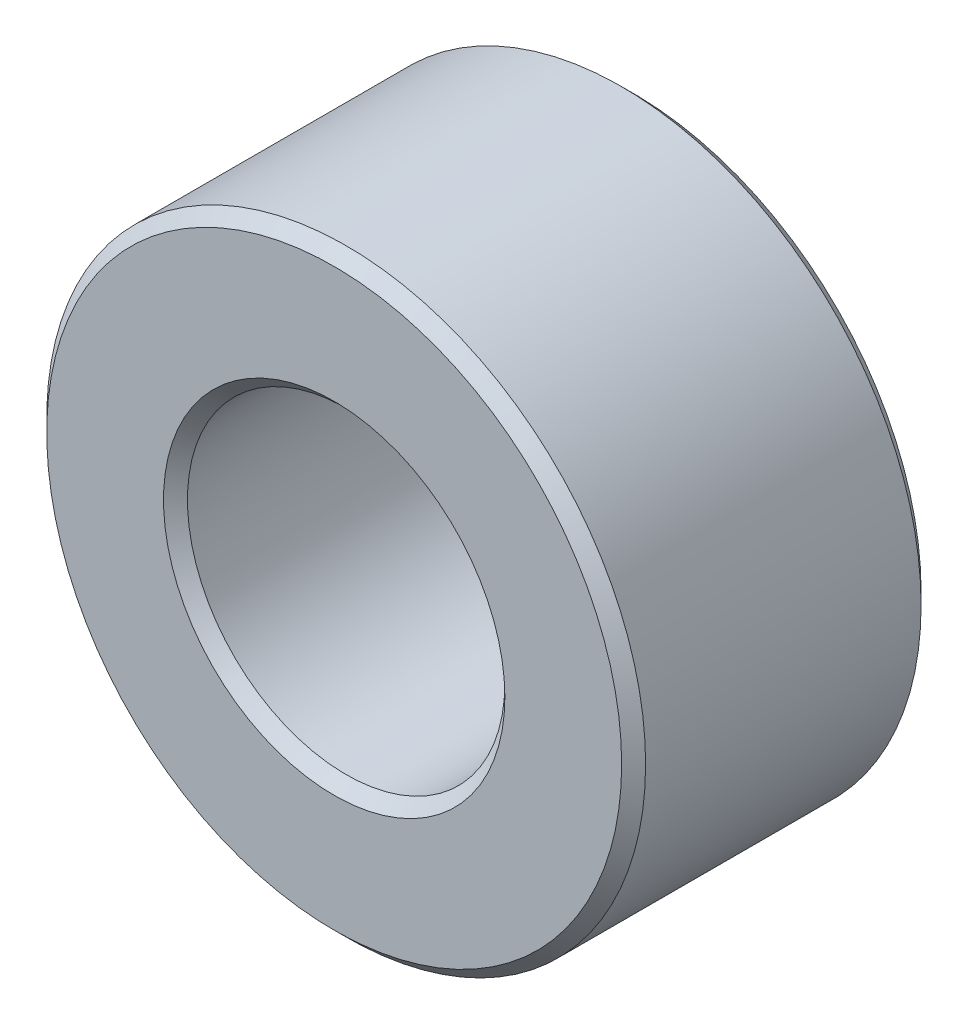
ISO-10303-21;
HEADER;
FILE_DESCRIPTION(('STEP AP214'),'2;1');
FILE_NAME('part.step','',(''),(''),'','','');
FILE_SCHEMA(('AUTOMOTIVE_DESIGN { 1 0 10303 214 1 1 1 1 }'));
ENDSEC;
DATA;
#1=APPLICATION_CONTEXT('core data for automotive mechanical design processes');
#2=APPLICATION_PROTOCOL_DEFINITION('international standard','automotive_design',2000,#1);
#3=PRODUCT_CONTEXT('',#1,'mechanical');
#4=PRODUCT('Part','Part','',(#3));
#5=PRODUCT_RELATED_PRODUCT_CATEGORY('part','',(#4));
#6=PRODUCT_DEFINITION_FORMATION('','',#4);
#7=PRODUCT_DEFINITION_CONTEXT('part definition',#1,'design');
#8=PRODUCT_DEFINITION('design','',#6,#7);
#9=PRODUCT_DEFINITION_SHAPE('','',#8);
#10=(LENGTH_UNIT() NAMED_UNIT(*) SI_UNIT(.MILLI.,.METRE.));
#11=(NAMED_UNIT(*) PLANE_ANGLE_UNIT() SI_UNIT($,.RADIAN.));
#12=(NAMED_UNIT(*) SI_UNIT($,.STERADIAN.) SOLID_ANGLE_UNIT());
#13=UNCERTAINTY_MEASURE_WITH_UNIT(LENGTH_MEASURE(1.E-05),#10,'distance_accuracy_value','');
#14=(GEOMETRIC_REPRESENTATION_CONTEXT(3) GLOBAL_UNCERTAINTY_ASSIGNED_CONTEXT((#13)) GLOBAL_UNIT_ASSIGNED_CONTEXT((#10,
#11,#12)) REPRESENTATION_CONTEXT('',''));
#15=CARTESIAN_POINT('',(0.,0.,0.));
#16=DIRECTION('',(0.,0.,1.));
#17=DIRECTION('',(1.,0.,0.));
#18=AXIS2_PLACEMENT_3D('',#15,#16,#17);
#19=CARTESIAN_POINT('',(0.,0.,2.5));
#20=DIRECTION('',(0.,0.,1.));
#21=DIRECTION('',(1.,0.,0.));
#22=AXIS2_PLACEMENT_3D('',#19,#20,#21);
#23=PLANE('',#22);
#24=CARTESIAN_POINT('',(0.,0.,2.5));
#25=DIRECTION('',(0.,0.,1.));
#26=DIRECTION('',(1.,0.,0.));
#27=AXIS2_PLACEMENT_3D('',#24,#25,#26);
#28=CIRCLE('',#27,2.85);
#29=CARTESIAN_POINT('',(2.85,0.,2.5));
#30=VERTEX_POINT('',#29);
#31=EDGE_CURVE('E10',#30,#30,#28,.F.);
#32=ORIENTED_EDGE('',*,*,#31,.T.);
#33=EDGE_LOOP('',(#32));
#34=FACE_BOUND('',#33,.T.);
#35=CARTESIAN_POINT('',(0.,0.,2.5));
#36=DIRECTION('',(0.,0.,1.));
#37=DIRECTION('',(1.,0.,0.));
#38=AXIS2_PLACEMENT_3D('',#35,#36,#37);
#39=CIRCLE('',#38,4.8);
#40=CARTESIAN_POINT('',(4.8,0.,2.5));
#41=VERTEX_POINT('',#40);
#42=EDGE_CURVE('E45',#41,#41,#39,.T.);
#43=ORIENTED_EDGE('',*,*,#42,.T.);
#44=EDGE_LOOP('',(#43));
#45=FACE_BOUND('',#44,.T.);
#46=ADVANCED_FACE('F37',(#34,#45),#23,.T.);
#47=CARTESIAN_POINT('',(0.,0.,-2.5));
#48=DIRECTION('',(0.,0.,1.));
#49=DIRECTION('',(1.,0.,0.));
#50=AXIS2_PLACEMENT_3D('',#47,#48,#49);
#51=PLANE('',#50);
#52=CARTESIAN_POINT('',(0.,0.,-2.5));
#53=DIRECTION('',(0.,0.,1.));
#54=DIRECTION('',(1.,0.,0.));
#55=AXIS2_PLACEMENT_3D('',#52,#53,#54);
#56=CIRCLE('',#55,4.8);
#57=CARTESIAN_POINT('',(4.8,0.,-2.5));
#58=VERTEX_POINT('',#57);
#59=EDGE_CURVE('E64',#58,#58,#56,.F.);
#60=ORIENTED_EDGE('',*,*,#59,.T.);
#61=EDGE_LOOP('',(#60));
#62=FACE_BOUND('',#61,.T.);
#63=CARTESIAN_POINT('',(0.,0.,-2.5));
#64=DIRECTION('',(0.,0.,1.));
#65=DIRECTION('',(1.,0.,0.));
#66=AXIS2_PLACEMENT_3D('',#63,#64,#65);
#67=CIRCLE('',#66,2.85);
#68=CARTESIAN_POINT('',(2.85,0.,-2.5));
#69=VERTEX_POINT('',#68);
#70=EDGE_CURVE('E68',#69,#69,#67,.T.);
#71=ORIENTED_EDGE('',*,*,#70,.T.);
#72=EDGE_LOOP('',(#71));
#73=FACE_BOUND('',#72,.T.);
#74=ADVANCED_FACE('F89',(#62,#73),#51,.F.);
#75=CARTESIAN_POINT('',(0.,0.,2.5));
#76=DIRECTION('',(0.,0.,-1.));
#77=DIRECTION('',(-1.,0.,0.));
#78=AXIS2_PLACEMENT_3D('',#75,#76,#77);
#79=CYLINDRICAL_SURFACE('',#78,5.);
#80=CARTESIAN_POINT('',(0.,0.,-2.3));
#81=DIRECTION('',(0.,0.,1.));
#82=DIRECTION('',(1.,0.,0.));
#83=AXIS2_PLACEMENT_3D('',#80,#81,#82);
#84=CIRCLE('',#83,5.);
#85=CARTESIAN_POINT('',(5.,0.,-2.3));
#86=VERTEX_POINT('',#85);
#87=EDGE_CURVE('E71',#86,#86,#84,.T.);
#88=ORIENTED_EDGE('',*,*,#87,.T.);
#89=EDGE_LOOP('',(#88));
#90=FACE_BOUND('',#89,.T.);
#91=CARTESIAN_POINT('',(0.,0.,2.3));
#92=DIRECTION('',(0.,0.,1.));
#93=DIRECTION('',(1.,0.,0.));
#94=AXIS2_PLACEMENT_3D('',#91,#92,#93);
#95=CIRCLE('',#94,5.);
#96=CARTESIAN_POINT('',(5.,0.,2.3));
#97=VERTEX_POINT('',#96);
#98=EDGE_CURVE('E74',#97,#97,#95,.F.);
#99=ORIENTED_EDGE('',*,*,#98,.T.);
#100=EDGE_LOOP('',(#99));
#101=FACE_BOUND('',#100,.T.);
#102=ADVANCED_FACE('F78',(#90,#101),#79,.T.);
#103=CARTESIAN_POINT('',(0.,0.,2.5));
#104=DIRECTION('',(0.,0.,-1.));
#105=DIRECTION('',(-1.,0.,0.));
#106=AXIS2_PLACEMENT_3D('',#103,#104,#105);
#107=CYLINDRICAL_SURFACE('',#106,2.65);
#108=CARTESIAN_POINT('',(0.,0.,-2.3));
#109=DIRECTION('',(0.,0.,1.));
#110=DIRECTION('',(1.,0.,0.));
#111=AXIS2_PLACEMENT_3D('',#108,#109,#110);
#112=CIRCLE('',#111,2.65);
#113=CARTESIAN_POINT('',(2.65,0.,-2.3));
#114=VERTEX_POINT('',#113);
#115=EDGE_CURVE('E52',#114,#114,#112,.F.);
#116=ORIENTED_EDGE('',*,*,#115,.T.);
#117=EDGE_LOOP('',(#116));
#118=FACE_BOUND('',#117,.T.);
#119=CARTESIAN_POINT('',(0.,0.,2.3));
#120=DIRECTION('',(0.,0.,1.));
#121=DIRECTION('',(1.,0.,0.));
#122=AXIS2_PLACEMENT_3D('',#119,#120,#121);
#123=CIRCLE('',#122,2.65);
#124=CARTESIAN_POINT('',(2.65,0.,2.3));
#125=VERTEX_POINT('',#124);
#126=EDGE_CURVE('E59',#125,#125,#123,.T.);
#127=ORIENTED_EDGE('',*,*,#126,.T.);
#128=EDGE_LOOP('',(#127));
#129=FACE_BOUND('',#128,.T.);
#130=ADVANCED_FACE('F97',(#118,#129),#107,.F.);
#131=CARTESIAN_POINT('',(0.,0.,-2.3));
#132=DIRECTION('',(0.,0.,1.));
#133=DIRECTION('',(1.,0.,0.));
#134=AXIS2_PLACEMENT_3D('',#131,#132,#133);
#135=CONICAL_SURFACE('',#134,5.,0.785398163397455);
#136=CARTESIAN_POINT('',(4.8,0.,-2.5));
#137=CARTESIAN_POINT('',(4.80208333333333,0.,-2.49791666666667));
#138=CARTESIAN_POINT('',(4.80416666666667,0.,-2.49583333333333));
#139=CARTESIAN_POINT('',(4.80833333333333,0.,-2.49166666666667));
#140=CARTESIAN_POINT('',(4.81041666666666,0.,-2.48958333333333));
#141=CARTESIAN_POINT('',(4.81458333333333,0.,-2.48541666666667));
#142=CARTESIAN_POINT('',(4.81666666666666,0.,-2.48333333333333));
#143=CARTESIAN_POINT('',(4.82083333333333,0.,-2.47916666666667));
#144=CARTESIAN_POINT('',(4.82291666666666,0.,-2.47708333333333));
#145=CARTESIAN_POINT('',(4.82708333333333,0.,-2.47291666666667));
#146=CARTESIAN_POINT('',(4.82916666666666,0.,-2.47083333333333));
#147=CARTESIAN_POINT('',(4.83333333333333,0.,-2.46666666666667));
#148=CARTESIAN_POINT('',(4.83541666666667,0.,-2.46458333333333));
#149=CARTESIAN_POINT('',(4.83958333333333,0.,-2.46041666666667));
#150=CARTESIAN_POINT('',(4.84166666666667,0.,-2.45833333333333));
#151=CARTESIAN_POINT('',(4.84583333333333,0.,-2.45416666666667));
#152=CARTESIAN_POINT('',(4.84791666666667,0.,-2.45208333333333));
#153=CARTESIAN_POINT('',(4.85208333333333,0.,-2.44791666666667));
#154=CARTESIAN_POINT('',(4.85416666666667,0.,-2.44583333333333));
#155=CARTESIAN_POINT('',(4.85833333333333,0.,-2.44166666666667));
#156=CARTESIAN_POINT('',(4.86041666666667,0.,-2.43958333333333));
#157=CARTESIAN_POINT('',(4.86458333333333,0.,-2.43541666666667));
#158=CARTESIAN_POINT('',(4.86666666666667,0.,-2.43333333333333));
#159=CARTESIAN_POINT('',(4.87083333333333,0.,-2.42916666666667));
#160=CARTESIAN_POINT('',(4.87291666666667,0.,-2.42708333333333));
#161=CARTESIAN_POINT('',(4.87708333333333,0.,-2.42291666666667));
#162=CARTESIAN_POINT('',(4.87916666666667,0.,-2.42083333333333));
#163=CARTESIAN_POINT('',(4.88333333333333,0.,-2.41666666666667));
#164=CARTESIAN_POINT('',(4.88541666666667,0.,-2.41458333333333));
#165=CARTESIAN_POINT('',(4.88958333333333,0.,-2.41041666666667));
#166=CARTESIAN_POINT('',(4.89166666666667,0.,-2.40833333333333));
#167=CARTESIAN_POINT('',(4.89583333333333,0.,-2.40416666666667));
#168=CARTESIAN_POINT('',(4.89791666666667,0.,-2.40208333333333));
#169=CARTESIAN_POINT('',(4.90208333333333,0.,-2.39791666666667));
#170=CARTESIAN_POINT('',(4.90416666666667,0.,-2.39583333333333));
#171=CARTESIAN_POINT('',(4.90833333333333,0.,-2.39166666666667));
#172=CARTESIAN_POINT('',(4.91041666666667,0.,-2.38958333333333));
#173=CARTESIAN_POINT('',(4.91458333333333,0.,-2.38541666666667));
#174=CARTESIAN_POINT('',(4.91666666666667,0.,-2.38333333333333));
#175=CARTESIAN_POINT('',(4.92083333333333,0.,-2.37916666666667));
#176=CARTESIAN_POINT('',(4.92291666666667,0.,-2.37708333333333));
#177=CARTESIAN_POINT('',(4.92708333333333,0.,-2.37291666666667));
#178=CARTESIAN_POINT('',(4.92916666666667,0.,-2.37083333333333));
#179=CARTESIAN_POINT('',(4.93333333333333,0.,-2.36666666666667));
#180=CARTESIAN_POINT('',(4.93541666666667,0.,-2.36458333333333));
#181=CARTESIAN_POINT('',(4.93958333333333,0.,-2.36041666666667));
#182=CARTESIAN_POINT('',(4.94166666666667,0.,-2.35833333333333));
#183=CARTESIAN_POINT('',(4.94583333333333,0.,-2.35416666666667));
#184=CARTESIAN_POINT('',(4.94791666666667,0.,-2.35208333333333));
#185=CARTESIAN_POINT('',(4.95208333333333,0.,-2.34791666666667));
#186=CARTESIAN_POINT('',(4.95416666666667,0.,-2.34583333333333));
#187=CARTESIAN_POINT('',(4.95833333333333,0.,-2.34166666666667));
#188=CARTESIAN_POINT('',(4.96041666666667,0.,-2.33958333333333));
#189=CARTESIAN_POINT('',(4.96458333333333,0.,-2.33541666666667));
#190=CARTESIAN_POINT('',(4.96666666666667,0.,-2.33333333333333));
#191=CARTESIAN_POINT('',(4.97083333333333,0.,-2.32916666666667));
#192=CARTESIAN_POINT('',(4.97291666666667,0.,-2.32708333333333));
#193=CARTESIAN_POINT('',(4.97708333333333,0.,-2.32291666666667));
#194=CARTESIAN_POINT('',(4.97916666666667,0.,-2.32083333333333));
#195=CARTESIAN_POINT('',(4.98333333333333,0.,-2.31666666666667));
#196=CARTESIAN_POINT('',(4.98541666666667,0.,-2.31458333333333));
#197=CARTESIAN_POINT('',(4.98958333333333,0.,-2.31041666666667));
#198=CARTESIAN_POINT('',(4.99166666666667,0.,-2.30833333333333));
#199=CARTESIAN_POINT('',(4.99583333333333,0.,-2.30416666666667));
#200=CARTESIAN_POINT('',(4.99791666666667,0.,-2.30208333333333));
#201=CARTESIAN_POINT('',(5.,0.,-2.3));
#202=B_SPLINE_CURVE_WITH_KNOTS('',3,(#136,#137,#138,#139,#140,#141,#142,#143,#144,#145,#146,
#147,#148,#149,#150,#151,#152,#153,#154,#155,#156,#157,#158,#159,#160,#161,#162,#163,#164,#165,
#166,#167,#168,#169,#170,#171,#172,#173,#174,#175,#176,#177,#178,#179,#180,#181,#182,#183,#184,
#185,#186,#187,#188,#189,#190,#191,#192,#193,#194,#195,#196,#197,#198,#199,#200,#201),
.UNSPECIFIED.,.F.,.F.,(4,2,2,2,2,2,2,2,2,2,2,2,2,2,2,2,2,2,2,2,2,2,2,2,2,2,2,2,2,2,2,2,4),(0.,
0.00883883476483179,0.0176776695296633,0.0265165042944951,0.0353553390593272,0.0441941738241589,
0.053033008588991,0.0618718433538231,0.0707106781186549,0.079549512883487,0.0883883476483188,
0.0972271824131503,0.106066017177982,0.114904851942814,0.123743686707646,0.132582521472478,
0.14142135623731,0.150260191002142,0.159099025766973,0.167937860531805,0.176776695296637,
0.185615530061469,0.194454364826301,0.203293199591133,0.212132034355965,0.220970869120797,
0.229809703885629,0.238648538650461,0.247487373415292,0.256326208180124,0.265165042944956,
0.274003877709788,0.28284271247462),.UNSPECIFIED.);
#203=EDGE_CURVE('BSEAM102',#58,#86,#202,.T.);
#204=ORIENTED_EDGE('',*,*,#59,.F.);
#205=ORIENTED_EDGE('',*,*,#87,.F.);
#206=ORIENTED_EDGE('',*,*,#203,.T.);
#207=ORIENTED_EDGE('',*,*,#203,.F.);
#208=EDGE_LOOP('',(#204,#206,#205,#207));
#209=FACE_BOUND('',#208,.T.);
#210=ADVANCED_FACE('F102',(#209),#135,.T.);
#211=CARTESIAN_POINT('',(0.,0.,-2.5));
#212=DIRECTION('',(0.,0.,-1.));
#213=DIRECTION('',(-1.,0.,0.));
#214=AXIS2_PLACEMENT_3D('',#211,#212,#213);
#215=CONICAL_SURFACE('',#214,2.85,0.785398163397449);
#216=ORIENTED_EDGE('',*,*,#115,.F.);
#217=EDGE_LOOP('',(#216));
#218=FACE_BOUND('',#217,.T.);
#219=ORIENTED_EDGE('',*,*,#70,.F.);
#220=EDGE_LOOP('',(#219));
#221=FACE_BOUND('',#220,.T.);
#222=ADVANCED_FACE('F86',(#218,#221),#215,.F.);
#223=CARTESIAN_POINT('',(0.,0.,2.3));
#224=DIRECTION('',(0.,0.,1.));
#225=DIRECTION('',(1.,0.,0.));
#226=AXIS2_PLACEMENT_3D('',#223,#224,#225);
#227=CONICAL_SURFACE('',#226,2.65,0.785398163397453);
#228=ORIENTED_EDGE('',*,*,#31,.F.);
#229=EDGE_LOOP('',(#228));
#230=FACE_BOUND('',#229,.T.);
#231=ORIENTED_EDGE('',*,*,#126,.F.);
#232=EDGE_LOOP('',(#231));
#233=FACE_BOUND('',#232,.T.);
#234=ADVANCED_FACE('F82',(#230,#233),#227,.F.);
#235=CARTESIAN_POINT('',(0.,0.,2.5));
#236=DIRECTION('',(0.,0.,-1.));
#237=DIRECTION('',(-1.,0.,0.));
#238=AXIS2_PLACEMENT_3D('',#235,#236,#237);
#239=CONICAL_SURFACE('',#238,4.8,0.785398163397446);
#240=ORIENTED_EDGE('',*,*,#98,.F.);
#241=EDGE_LOOP('',(#240));
#242=FACE_BOUND('',#241,.T.);
#243=ORIENTED_EDGE('',*,*,#42,.F.);
#244=EDGE_LOOP('',(#243));
#245=FACE_BOUND('',#244,.T.);
#246=ADVANCED_FACE('F39',(#242,#245),#239,.T.);
#247=CLOSED_SHELL('',(#46,#74,#102,#130,#210,#222,#234,#246));
#248=MANIFOLD_SOLID_BREP('B2',#247);
#249=ADVANCED_BREP_SHAPE_REPRESENTATION('',(#18,#248),#14);
#250=SHAPE_DEFINITION_REPRESENTATION(#9,#249);
ENDSEC;
END-ISO-10303-21;
